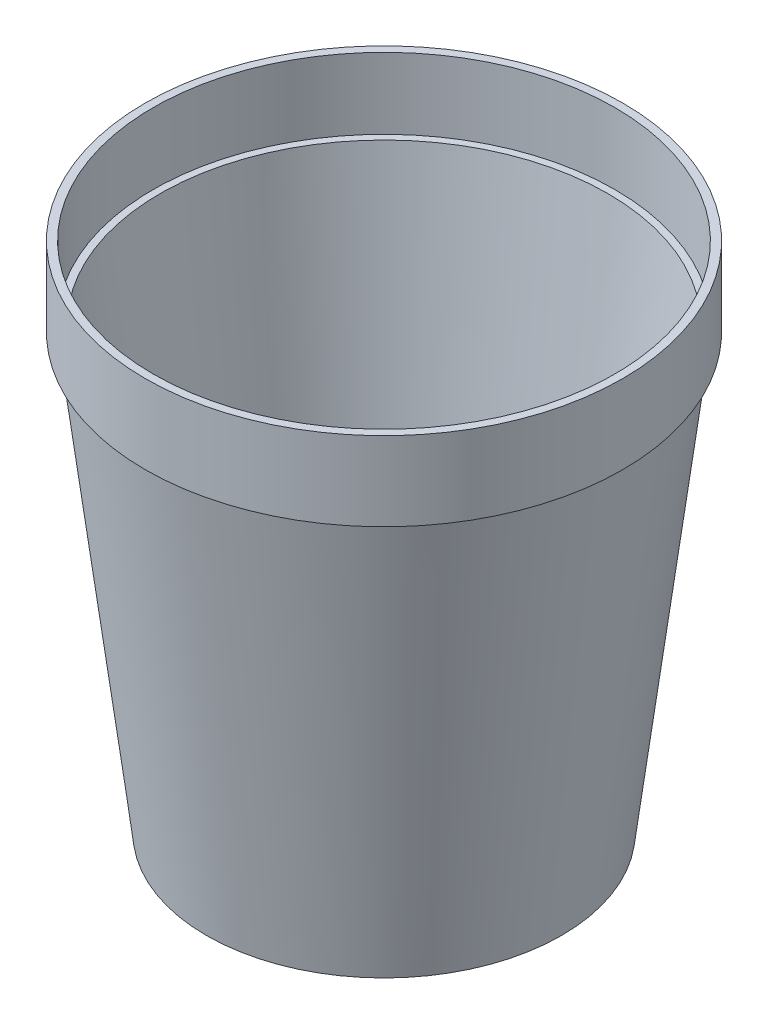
ISO-10303-21;
HEADER;
FILE_DESCRIPTION(('STEP AP214'),'2;1');
FILE_NAME('part.step','',(''),(''),'','','');
FILE_SCHEMA(('AUTOMOTIVE_DESIGN { 1 0 10303 214 1 1 1 1 }'));
ENDSEC;
DATA;
#1=APPLICATION_CONTEXT('core data for automotive mechanical design processes');
#2=APPLICATION_PROTOCOL_DEFINITION('international standard','automotive_design',2000,#1);
#3=PRODUCT_CONTEXT('',#1,'mechanical');
#4=PRODUCT('Part','Part','',(#3));
#5=PRODUCT_RELATED_PRODUCT_CATEGORY('part','',(#4));
#6=PRODUCT_DEFINITION_FORMATION('','',#4);
#7=PRODUCT_DEFINITION_CONTEXT('part definition',#1,'design');
#8=PRODUCT_DEFINITION('design','',#6,#7);
#9=PRODUCT_DEFINITION_SHAPE('','',#8);
#10=(LENGTH_UNIT() NAMED_UNIT(*) SI_UNIT(.MILLI.,.METRE.));
#11=(NAMED_UNIT(*) PLANE_ANGLE_UNIT() SI_UNIT($,.RADIAN.));
#12=(NAMED_UNIT(*) SI_UNIT($,.STERADIAN.) SOLID_ANGLE_UNIT());
#13=UNCERTAINTY_MEASURE_WITH_UNIT(LENGTH_MEASURE(1.E-05),#10,'distance_accuracy_value','');
#14=(GEOMETRIC_REPRESENTATION_CONTEXT(3) GLOBAL_UNCERTAINTY_ASSIGNED_CONTEXT((#13)) GLOBAL_UNIT_ASSIGNED_CONTEXT((#10,
#11,#12)) REPRESENTATION_CONTEXT('',''));
#15=CARTESIAN_POINT('',(0.,0.,0.));
#16=DIRECTION('',(0.,0.,1.));
#17=DIRECTION('',(1.,0.,0.));
#18=AXIS2_PLACEMENT_3D('',#15,#16,#17);
#19=CARTESIAN_POINT('',(45.,0.,0.));
#20=DIRECTION('',(0.,-1.,0.));
#21=DIRECTION('',(0.,0.,-1.));
#22=AXIS2_PLACEMENT_3D('',#19,#20,#21);
#23=PLANE('',#22);
#24=CARTESIAN_POINT('',(0.,0.,0.));
#25=DIRECTION('',(0.,-1.,0.));
#26=DIRECTION('',(0.,0.,-1.));
#27=AXIS2_PLACEMENT_3D('',#24,#25,#26);
#28=CIRCLE('',#27,45.);
#29=CARTESIAN_POINT('',(0.,0.,-45.));
#30=VERTEX_POINT('',#29);
#31=EDGE_CURVE('E44',#30,#30,#28,.T.);
#32=ORIENTED_EDGE('',*,*,#31,.T.);
#33=EDGE_LOOP('',(#32));
#34=FACE_BOUND('',#33,.T.);
#35=ADVANCED_FACE('F30',(#34),#23,.T.);
#36=CARTESIAN_POINT('',(0.,130.,0.));
#37=DIRECTION('',(0.,1.,0.));
#38=DIRECTION('',(0.,0.,1.));
#39=AXIS2_PLACEMENT_3D('',#36,#37,#38);
#40=PLANE('',#39);
#41=CARTESIAN_POINT('',(0.,130.,0.));
#42=DIRECTION('',(0.,1.,0.));
#43=DIRECTION('',(0.,0.,1.));
#44=AXIS2_PLACEMENT_3D('',#41,#42,#43);
#45=CIRCLE('',#44,58.5063016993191);
#46=CARTESIAN_POINT('',(0.,130.,58.5063016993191));
#47=VERTEX_POINT('',#46);
#48=EDGE_CURVE('E49',#47,#47,#45,.F.);
#49=ORIENTED_EDGE('',*,*,#48,.T.);
#50=EDGE_LOOP('',(#49));
#51=FACE_BOUND('',#50,.T.);
#52=CARTESIAN_POINT('',(0.,130.,0.));
#53=DIRECTION('',(0.,-1.,0.));
#54=DIRECTION('',(0.,0.,-1.));
#55=AXIS2_PLACEMENT_3D('',#52,#53,#54);
#56=CIRCLE('',#55,60.5063016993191);
#57=CARTESIAN_POINT('',(0.,130.,-60.5063016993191));
#58=VERTEX_POINT('',#57);
#59=EDGE_CURVE('E10',#58,#58,#56,.T.);
#60=ORIENTED_EDGE('',*,*,#59,.F.);
#61=EDGE_LOOP('',(#60));
#62=FACE_BOUND('',#61,.T.);
#63=ADVANCED_FACE('F80',(#51,#62),#40,.T.);
#64=CARTESIAN_POINT('',(0.,0.,0.));
#65=DIRECTION('',(0.,-1.,0.));
#66=DIRECTION('',(0.,0.,-1.));
#67=AXIS2_PLACEMENT_3D('',#64,#65,#66);
#68=CYLINDRICAL_SURFACE('',#67,60.5063016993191);
#69=ORIENTED_EDGE('',*,*,#59,.T.);
#70=EDGE_LOOP('',(#69));
#71=FACE_BOUND('',#70,.T.);
#72=CARTESIAN_POINT('',(0.,110.,0.));
#73=DIRECTION('',(0.,-1.,0.));
#74=DIRECTION('',(0.,0.,-1.));
#75=AXIS2_PLACEMENT_3D('',#72,#73,#74);
#76=CIRCLE('',#75,60.5063016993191);
#77=CARTESIAN_POINT('',(0.,110.,-60.5063016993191));
#78=VERTEX_POINT('',#77);
#79=EDGE_CURVE('E36',#78,#78,#76,.T.);
#80=ORIENTED_EDGE('',*,*,#79,.F.);
#81=EDGE_LOOP('',(#80));
#82=FACE_BOUND('',#81,.T.);
#83=ADVANCED_FACE('F85',(#71,#82),#68,.T.);
#84=CARTESIAN_POINT('',(60.5063016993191,110.,0.));
#85=DIRECTION('',(0.,-1.,0.));
#86=DIRECTION('',(0.,0.,-1.));
#87=AXIS2_PLACEMENT_3D('',#84,#85,#86);
#88=PLANE('',#87);
#89=ORIENTED_EDGE('',*,*,#79,.T.);
#90=EDGE_LOOP('',(#89));
#91=FACE_BOUND('',#90,.T.);
#92=CARTESIAN_POINT('',(0.,110.,0.));
#93=DIRECTION('',(0.,-1.,0.));
#94=DIRECTION('',(0.,0.,-1.));
#95=AXIS2_PLACEMENT_3D('',#92,#93,#94);
#96=CIRCLE('',#95,58.5063016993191);
#97=CARTESIAN_POINT('',(0.,110.,-58.5063016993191));
#98=VERTEX_POINT('',#97);
#99=EDGE_CURVE('E40',#98,#98,#96,.T.);
#100=ORIENTED_EDGE('',*,*,#99,.F.);
#101=EDGE_LOOP('',(#100));
#102=FACE_BOUND('',#101,.T.);
#103=ADVANCED_FACE('F76',(#91,#102),#88,.T.);
#104=CARTESIAN_POINT('',(0.,0.,0.));
#105=DIRECTION('',(0.,1.,0.));
#106=DIRECTION('',(0.,0.,1.));
#107=AXIS2_PLACEMENT_3D('',#104,#105,#106);
#108=CONICAL_SURFACE('',#107,45.,0.1221730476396);
#109=ORIENTED_EDGE('',*,*,#99,.T.);
#110=EDGE_LOOP('',(#109));
#111=FACE_BOUND('',#110,.T.);
#112=ORIENTED_EDGE('',*,*,#31,.F.);
#113=EDGE_LOOP('',(#112));
#114=FACE_BOUND('',#113,.T.);
#115=ADVANCED_FACE('F67',(#111,#114),#108,.T.);
#116=CARTESIAN_POINT('',(45.,2.,0.));
#117=DIRECTION('',(0.,-1.,0.));
#118=DIRECTION('',(0.,0.,-1.));
#119=AXIS2_PLACEMENT_3D('',#116,#117,#118);
#120=PLANE('',#119);
#121=CARTESIAN_POINT('',(0.,2.,0.));
#122=DIRECTION('',(0.,-1.,0.));
#123=DIRECTION('',(0.,0.,-1.));
#124=AXIS2_PLACEMENT_3D('',#121,#122,#123);
#125=CIRCLE('',#124,43.2305494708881);
#126=CARTESIAN_POINT('',(0.,2.,-43.2305494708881));
#127=VERTEX_POINT('',#126);
#128=EDGE_CURVE('E58',#127,#127,#125,.T.);
#129=ORIENTED_EDGE('',*,*,#128,.F.);
#130=EDGE_LOOP('',(#129));
#131=FACE_BOUND('',#130,.T.);
#132=ADVANCED_FACE('F64',(#131),#120,.F.);
#133=CARTESIAN_POINT('',(0.,0.,0.));
#134=DIRECTION('',(0.,-1.,0.));
#135=DIRECTION('',(0.,0.,-1.));
#136=AXIS2_PLACEMENT_3D('',#133,#134,#135);
#137=CYLINDRICAL_SURFACE('',#136,58.5063016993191);
#138=ORIENTED_EDGE('',*,*,#48,.F.);
#139=EDGE_LOOP('',(#138));
#140=FACE_BOUND('',#139,.T.);
#141=CARTESIAN_POINT('',(0.,112.,0.));
#142=DIRECTION('',(0.,-1.,0.));
#143=DIRECTION('',(0.,0.,-1.));
#144=AXIS2_PLACEMENT_3D('',#141,#142,#143);
#145=CIRCLE('',#144,58.5063016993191);
#146=CARTESIAN_POINT('',(0.,112.,-58.5063016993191));
#147=VERTEX_POINT('',#146);
#148=EDGE_CURVE('E52',#147,#147,#145,.T.);
#149=ORIENTED_EDGE('',*,*,#148,.T.);
#150=EDGE_LOOP('',(#149));
#151=FACE_BOUND('',#150,.T.);
#152=ADVANCED_FACE('F66',(#140,#151),#137,.F.);
#153=CARTESIAN_POINT('',(60.5063016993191,112.,0.));
#154=DIRECTION('',(0.,-1.,0.));
#155=DIRECTION('',(0.,0.,-1.));
#156=AXIS2_PLACEMENT_3D('',#153,#154,#155);
#157=PLANE('',#156);
#158=ORIENTED_EDGE('',*,*,#148,.F.);
#159=EDGE_LOOP('',(#158));
#160=FACE_BOUND('',#159,.T.);
#161=CARTESIAN_POINT('',(0.,112.,0.));
#162=DIRECTION('',(0.,-1.,0.));
#163=DIRECTION('',(0.,0.,-1.));
#164=AXIS2_PLACEMENT_3D('',#161,#162,#163);
#165=CIRCLE('',#164,56.7368511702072);
#166=CARTESIAN_POINT('',(0.,112.,-56.7368511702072));
#167=VERTEX_POINT('',#166);
#168=EDGE_CURVE('E55',#167,#167,#165,.T.);
#169=ORIENTED_EDGE('',*,*,#168,.T.);
#170=EDGE_LOOP('',(#169));
#171=FACE_BOUND('',#170,.T.);
#172=ADVANCED_FACE('F73',(#160,#171),#157,.F.);
#173=CARTESIAN_POINT('',(0.,0.243738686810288,0.));
#174=DIRECTION('',(0.,1.,0.));
#175=DIRECTION('',(0.,0.,1.));
#176=AXIS2_PLACEMENT_3D('',#173,#174,#175);
#177=CONICAL_SURFACE('',#176,43.0149076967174,0.1221730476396);
#178=ORIENTED_EDGE('',*,*,#168,.F.);
#179=EDGE_LOOP('',(#178));
#180=FACE_BOUND('',#179,.T.);
#181=ORIENTED_EDGE('',*,*,#128,.T.);
#182=EDGE_LOOP('',(#181));
#183=FACE_BOUND('',#182,.T.);
#184=ADVANCED_FACE('F62',(#180,#183),#177,.F.);
#185=CLOSED_SHELL('',(#35,#63,#83,#103,#115,#132,#152,#172,#184));
#186=MANIFOLD_SOLID_BREP('B2',#185);
#187=ADVANCED_BREP_SHAPE_REPRESENTATION('',(#18,#186),#14);
#188=SHAPE_DEFINITION_REPRESENTATION(#9,#187);
ENDSEC;
END-ISO-10303-21;
